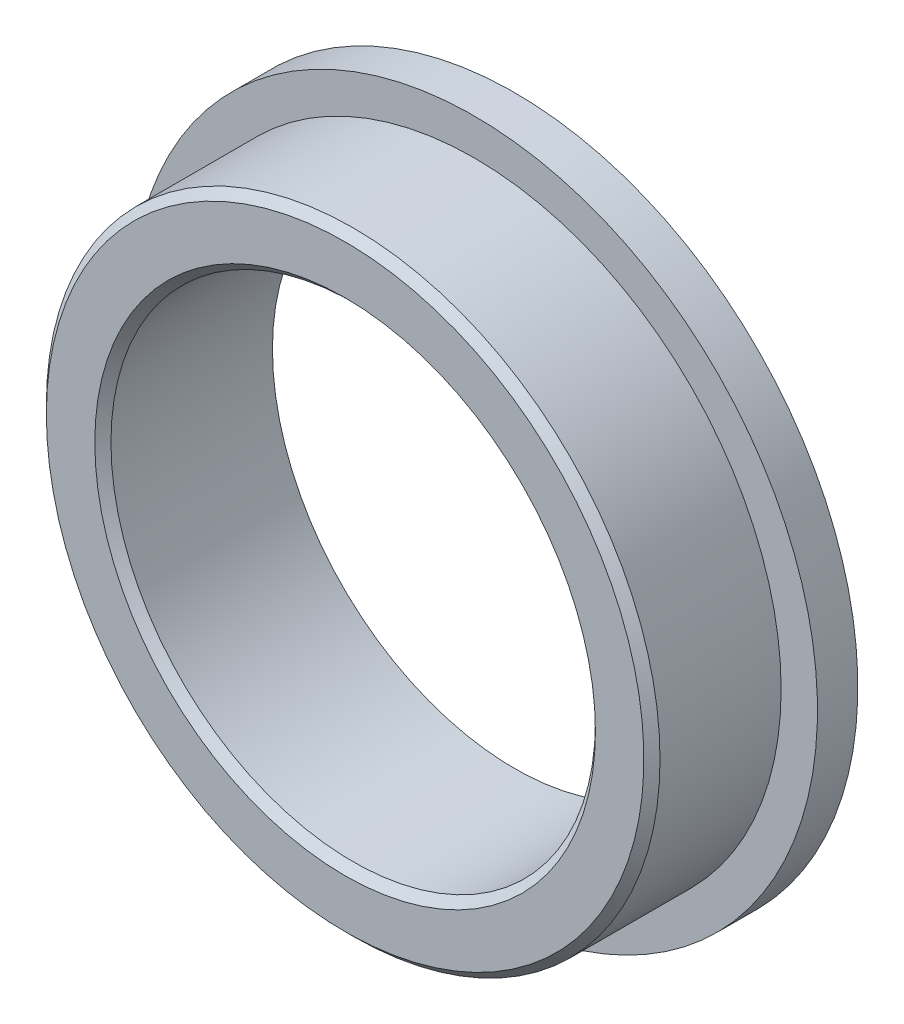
ISO-10303-21;
HEADER;
FILE_DESCRIPTION(('STEP AP214'),'2;1');
FILE_NAME('part.step','',(''),(''),'','','');
FILE_SCHEMA(('AUTOMOTIVE_DESIGN { 1 0 10303 214 1 1 1 1 }'));
ENDSEC;
DATA;
#1=APPLICATION_CONTEXT('core data for automotive mechanical design processes');
#2=APPLICATION_PROTOCOL_DEFINITION('international standard','automotive_design',2000,#1);
#3=PRODUCT_CONTEXT('',#1,'mechanical');
#4=PRODUCT('Part','Part','',(#3));
#5=PRODUCT_RELATED_PRODUCT_CATEGORY('part','',(#4));
#6=PRODUCT_DEFINITION_FORMATION('','',#4);
#7=PRODUCT_DEFINITION_CONTEXT('part definition',#1,'design');
#8=PRODUCT_DEFINITION('design','',#6,#7);
#9=PRODUCT_DEFINITION_SHAPE('','',#8);
#10=(LENGTH_UNIT() NAMED_UNIT(*) SI_UNIT(.MILLI.,.METRE.));
#11=(NAMED_UNIT(*) PLANE_ANGLE_UNIT() SI_UNIT($,.RADIAN.));
#12=(NAMED_UNIT(*) SI_UNIT($,.STERADIAN.) SOLID_ANGLE_UNIT());
#13=UNCERTAINTY_MEASURE_WITH_UNIT(LENGTH_MEASURE(1.E-05),#10,'distance_accuracy_value','');
#14=(GEOMETRIC_REPRESENTATION_CONTEXT(3) GLOBAL_UNCERTAINTY_ASSIGNED_CONTEXT((#13)) GLOBAL_UNIT_ASSIGNED_CONTEXT((#10,
#11,#12)) REPRESENTATION_CONTEXT('',''));
#15=CARTESIAN_POINT('',(0.,0.,0.));
#16=DIRECTION('',(0.,0.,1.));
#17=DIRECTION('',(1.,0.,0.));
#18=AXIS2_PLACEMENT_3D('',#15,#16,#17);
#19=CARTESIAN_POINT('',(0.,0.,1.99999999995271));
#20=DIRECTION('',(0.,0.,-1.));
#21=DIRECTION('',(-1.,0.,0.));
#22=AXIS2_PLACEMENT_3D('',#19,#20,#21);
#23=CONICAL_SURFACE('',#22,3.80000000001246,0.785398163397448);
#24=CARTESIAN_POINT('',(0.,0.,2.));
#25=DIRECTION('',(0.,0.,1.));
#26=DIRECTION('',(1.,0.,0.));
#27=AXIS2_PLACEMENT_3D('',#24,#25,#26);
#28=CIRCLE('',#27,3.8);
#29=CARTESIAN_POINT('',(3.8,0.,2.));
#30=VERTEX_POINT('',#29);
#31=EDGE_CURVE('E30',#30,#30,#28,.F.);
#32=ORIENTED_EDGE('',*,*,#31,.F.);
#33=EDGE_LOOP('',(#32));
#34=FACE_BOUND('',#33,.T.);
#35=CARTESIAN_POINT('',(0.,0.,2.09999999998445));
#36=DIRECTION('',(0.,0.,-1.));
#37=DIRECTION('',(-1.,0.,0.));
#38=AXIS2_PLACEMENT_3D('',#35,#36,#37);
#39=CIRCLE('',#38,3.69999999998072);
#40=CARTESIAN_POINT('',(-3.69999999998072,0.,2.09999999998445));
#41=VERTEX_POINT('',#40);
#42=EDGE_CURVE('E18',#41,#41,#39,.F.);
#43=ORIENTED_EDGE('',*,*,#42,.F.);
#44=EDGE_LOOP('',(#43));
#45=FACE_BOUND('',#44,.T.);
#46=ADVANCED_FACE('F15',(#34,#45),#23,.T.);
#47=CARTESIAN_POINT('',(0.,0.,-12.0208152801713));
#48=DIRECTION('',(0.,0.,1.));
#49=DIRECTION('',(1.,0.,0.));
#50=AXIS2_PLACEMENT_3D('',#47,#48,#49);
#51=CYLINDRICAL_SURFACE('',#50,3.8);
#52=ORIENTED_EDGE('',*,*,#31,.T.);
#53=EDGE_LOOP('',(#52));
#54=FACE_BOUND('',#53,.T.);
#55=CARTESIAN_POINT('',(0.,0.,0.5));
#56=DIRECTION('',(0.,0.,1.));
#57=DIRECTION('',(1.,0.,0.));
#58=AXIS2_PLACEMENT_3D('',#55,#56,#57);
#59=CIRCLE('',#58,3.8);
#60=CARTESIAN_POINT('',(3.8,0.,0.5));
#61=VERTEX_POINT('',#60);
#62=EDGE_CURVE('E38',#61,#61,#59,.F.);
#63=ORIENTED_EDGE('',*,*,#62,.F.);
#64=EDGE_LOOP('',(#63));
#65=FACE_BOUND('',#64,.T.);
#66=ADVANCED_FACE('F48',(#54,#65),#51,.T.);
#67=CARTESIAN_POINT('',(0.,0.,2.1));
#68=DIRECTION('',(0.,0.,1.));
#69=DIRECTION('',(1.,0.,0.));
#70=AXIS2_PLACEMENT_3D('',#67,#68,#69);
#71=PLANE('',#70);
#72=CARTESIAN_POINT('',(0.,0.,2.09999999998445));
#73=DIRECTION('',(0.,0.,1.));
#74=DIRECTION('',(1.,0.,0.));
#75=AXIS2_PLACEMENT_3D('',#72,#73,#74);
#76=CIRCLE('',#75,3.0999999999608);
#77=CARTESIAN_POINT('',(3.0999999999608,0.,2.09999999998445));
#78=VERTEX_POINT('',#77);
#79=EDGE_CURVE('E36',#78,#78,#76,.F.);
#80=ORIENTED_EDGE('',*,*,#79,.T.);
#81=EDGE_LOOP('',(#80));
#82=FACE_BOUND('',#81,.T.);
#83=ORIENTED_EDGE('',*,*,#42,.T.);
#84=EDGE_LOOP('',(#83));
#85=FACE_BOUND('',#84,.T.);
#86=ADVANCED_FACE('F57',(#82,#85),#71,.T.);
#87=CARTESIAN_POINT('',(0.,0.,0.5));
#88=DIRECTION('',(0.,0.,1.));
#89=DIRECTION('',(1.,0.,0.));
#90=AXIS2_PLACEMENT_3D('',#87,#88,#89);
#91=PLANE('',#90);
#92=ORIENTED_EDGE('',*,*,#62,.T.);
#93=EDGE_LOOP('',(#92));
#94=FACE_BOUND('',#93,.T.);
#95=CARTESIAN_POINT('',(0.,0.,0.5));
#96=DIRECTION('',(0.,0.,-1.));
#97=DIRECTION('',(-1.,0.,0.));
#98=AXIS2_PLACEMENT_3D('',#95,#96,#97);
#99=CIRCLE('',#98,4.25);
#100=CARTESIAN_POINT('',(-4.25,0.,0.5));
#101=VERTEX_POINT('',#100);
#102=EDGE_CURVE('E33',#101,#101,#99,.T.);
#103=ORIENTED_EDGE('',*,*,#102,.F.);
#104=EDGE_LOOP('',(#103));
#105=FACE_BOUND('',#104,.T.);
#106=ADVANCED_FACE('F76',(#94,#105),#91,.T.);
#107=CARTESIAN_POINT('',(0.,0.,2.09999999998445));
#108=DIRECTION('',(0.,0.,1.));
#109=DIRECTION('',(1.,0.,0.));
#110=AXIS2_PLACEMENT_3D('',#107,#108,#109);
#111=CONICAL_SURFACE('',#110,3.0999999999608,0.785398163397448);
#112=ORIENTED_EDGE('',*,*,#79,.F.);
#113=EDGE_LOOP('',(#112));
#114=FACE_BOUND('',#113,.T.);
#115=CARTESIAN_POINT('',(0.,0.,2.));
#116=DIRECTION('',(0.,0.,-1.));
#117=DIRECTION('',(-1.,0.,0.));
#118=AXIS2_PLACEMENT_3D('',#115,#116,#117);
#119=CIRCLE('',#118,3.);
#120=CARTESIAN_POINT('',(-3.,0.,2.));
#121=VERTEX_POINT('',#120);
#122=EDGE_CURVE('E27',#121,#121,#119,.T.);
#123=ORIENTED_EDGE('',*,*,#122,.T.);
#124=EDGE_LOOP('',(#123));
#125=FACE_BOUND('',#124,.T.);
#126=ADVANCED_FACE('F72',(#114,#125),#111,.F.);
#127=CARTESIAN_POINT('',(0.,0.,2.1));
#128=DIRECTION('',(0.,0.,-1.));
#129=DIRECTION('',(-1.,0.,0.));
#130=AXIS2_PLACEMENT_3D('',#127,#128,#129);
#131=CYLINDRICAL_SURFACE('',#130,4.25);
#132=ORIENTED_EDGE('',*,*,#102,.T.);
#133=EDGE_LOOP('',(#132));
#134=FACE_BOUND('',#133,.T.);
#135=CARTESIAN_POINT('',(0.,0.,0.));
#136=DIRECTION('',(0.,0.,-1.));
#137=DIRECTION('',(-1.,0.,0.));
#138=AXIS2_PLACEMENT_3D('',#135,#136,#137);
#139=CIRCLE('',#138,4.25);
#140=CARTESIAN_POINT('',(-4.25,0.,0.));
#141=VERTEX_POINT('',#140);
#142=EDGE_CURVE('E22',#141,#141,#139,.F.);
#143=ORIENTED_EDGE('',*,*,#142,.T.);
#144=EDGE_LOOP('',(#143));
#145=FACE_BOUND('',#144,.T.);
#146=ADVANCED_FACE('F66',(#134,#145),#131,.T.);
#147=CARTESIAN_POINT('',(0.,0.,2.1));
#148=DIRECTION('',(0.,0.,-1.));
#149=DIRECTION('',(-1.,0.,0.));
#150=AXIS2_PLACEMENT_3D('',#147,#148,#149);
#151=CYLINDRICAL_SURFACE('',#150,3.);
#152=CARTESIAN_POINT('',(0.,0.,0.));
#153=DIRECTION('',(0.,0.,-1.));
#154=DIRECTION('',(-1.,0.,0.));
#155=AXIS2_PLACEMENT_3D('',#152,#153,#154);
#156=CIRCLE('',#155,3.);
#157=CARTESIAN_POINT('',(-3.,0.,0.));
#158=VERTEX_POINT('',#157);
#159=EDGE_CURVE('E10',#158,#158,#156,.T.);
#160=ORIENTED_EDGE('',*,*,#159,.T.);
#161=EDGE_LOOP('',(#160));
#162=FACE_BOUND('',#161,.T.);
#163=ORIENTED_EDGE('',*,*,#122,.F.);
#164=EDGE_LOOP('',(#163));
#165=FACE_BOUND('',#164,.T.);
#166=ADVANCED_FACE('F60',(#162,#165),#151,.F.);
#167=CARTESIAN_POINT('',(0.,0.,0.));
#168=DIRECTION('',(0.,0.,1.));
#169=DIRECTION('',(1.,0.,0.));
#170=AXIS2_PLACEMENT_3D('',#167,#168,#169);
#171=PLANE('',#170);
#172=ORIENTED_EDGE('',*,*,#159,.F.);
#173=EDGE_LOOP('',(#172));
#174=FACE_BOUND('',#173,.T.);
#175=ORIENTED_EDGE('',*,*,#142,.F.);
#176=EDGE_LOOP('',(#175));
#177=FACE_BOUND('',#176,.T.);
#178=ADVANCED_FACE('F58',(#174,#177),#171,.F.);
#179=CLOSED_SHELL('',(#46,#66,#86,#106,#126,#146,#166,#178));
#180=MANIFOLD_SOLID_BREP('B1',#179);
#181=ADVANCED_BREP_SHAPE_REPRESENTATION('',(#18,#180),#14);
#182=SHAPE_DEFINITION_REPRESENTATION(#9,#181);
ENDSEC;
END-ISO-10303-21;
